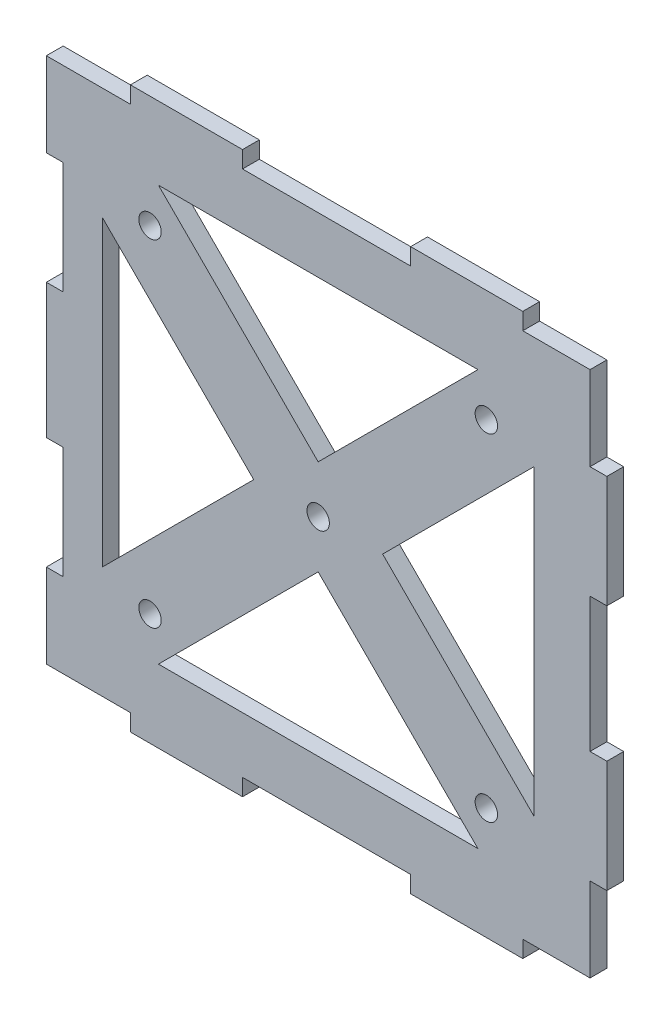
from build123d import *

# Parameters (mm, degrees)
ESQUISSE1_W             = 97
ESQUISSE1_H             = 94
ESQUISSE1_W_2           = 77
ESQUISSE1_H_2           = 74
ESQUISSE1_R             = 2
BOSS_EXTRU_1_DEPTH      = 3
ENL_V_MAT_EXTRU_1_REACH = 131.232
ESQUISSE2_W             = 3
ESQUISSE2_H             = 20
ESQUISSE3_W             = 20
ESQUISSE3_H             = 3
BOSS_EXTRU_2_DEPTH      = 3
ESQUISSE4_W             = 3
ESQUISSE4_H             = 20
BOSS_EXTRU_3_DEPTH      = 3
ESQUISSE5_W             = 20
ESQUISSE5_H             = 3
BOSS_EXTRU_4_DEPTH      = 3


with BuildPart() as part:
    # Esquisse1 → Boss.-Extru.1 (new body)
    # profile 1 of 2: a face of its own
    with BuildSketch(Plane.XY):
        with Locations((-36.351443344, 50.427454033)):
            Rectangle(ESQUISSE1_W, ESQUISSE1_H)
        with Locations((-36.351443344, 50.427454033)):
            Rectangle(ESQUISSE1_W_2, ESQUISSE1_H_2, mode=Mode.SUBTRACT)
    # profile 2 of 2: a face of its own
    with BuildSketch(Plane.XY):
        Polygon((-64.851443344, 87.427454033), (-74.851443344, 87.427454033), (-74.851443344, 77.427454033), (-47.851443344, 50.427454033), (-74.851443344, 23.427454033), (-74.851443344, 13.427454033), (-64.851443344, 13.427454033), (-36.351443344, 41.927454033), (-7.851443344, 13.427454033), (2.148556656, 13.427454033), (2.148556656, 23.427454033), (-24.851443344, 50.427454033), (2.148556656, 77.427454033), (2.148556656, 87.427454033), (-7.851443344, 87.427454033), (-36.351443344, 58.927454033), align=None)
        with Locations((-66.351443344, 20.427454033)):
            Circle(ESQUISSE1_R, mode=Mode.SUBTRACT)
        with Locations((-6.351443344, 20.427454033)):
            Circle(ESQUISSE1_R, mode=Mode.SUBTRACT)
        with Locations((-66.351443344, 80.427454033)):
            Circle(ESQUISSE1_R, mode=Mode.SUBTRACT)
        with Locations((-36.351443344, 50.427454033)):
            Circle(ESQUISSE1_R, mode=Mode.SUBTRACT)
        with Locations((-6.351443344, 80.427454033)):
            Circle(ESQUISSE1_R, mode=Mode.SUBTRACT)
    extrude(amount=BOSS_EXTRU_1_DEPTH)

    # Esquisse2 → Enl_v. mat.-Extru.1 (cut, up to next)
    with BuildSketch(Plane.XY.offset(3), mode=Mode.PRIVATE) as enl_v_mat_extru_1_sk1:
        with Locations((-83.351443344, 28.427454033)):
            Rectangle(ESQUISSE2_W, ESQUISSE2_H)
    enl_v_mat_extru_1_tool1 = extrude(enl_v_mat_extru_1_sk1.sketch, amount=-ENL_V_MAT_EXTRU_1_REACH, mode=Mode.PRIVATE) & part.part
    # Esquisse2 → Enl_v. mat.-Extru.1 (cut, up to next)
    with BuildSketch(Plane.XY.offset(3), mode=Mode.PRIVATE) as enl_v_mat_extru_1_sk2:
        with Locations((-83.351443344, 72.427454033)):
            Rectangle(ESQUISSE2_W, ESQUISSE2_H)
    enl_v_mat_extru_1_tool2 = extrude(enl_v_mat_extru_1_sk2.sketch, amount=-ENL_V_MAT_EXTRU_1_REACH, mode=Mode.PRIVATE) & part.part
    add(enl_v_mat_extru_1_tool1.solids().sort_by_distance((-83.351443, 28.427454, 3))[0], mode=Mode.SUBTRACT)
    add(enl_v_mat_extru_1_tool2.solids().sort_by_distance((-83.351443, 72.427454, 3))[0], mode=Mode.SUBTRACT)

    # Esquisse3 → Boss.-Extru.2 (add)
    with BuildSketch(Plane(origin=(0, 97.427454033, 0), x_dir=(1, 0, 0), z_dir=(0, 1, 0))):
        with Locations((-59.851443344, -1.5)):
            Rectangle(ESQUISSE3_W, ESQUISSE3_H)
        with Locations((-9.851443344, -1.5)):
            Rectangle(ESQUISSE3_W, ESQUISSE3_H)
    extrude(amount=BOSS_EXTRU_2_DEPTH)

    # Esquisse4 → Boss.-Extru.3 (add)
    with BuildSketch(Plane(origin=(12.148556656, 0, 0), x_dir=(0, 0, -1), z_dir=(1, 0, 0))):
        with Locations((-1.5, 72.427454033)):
            Rectangle(ESQUISSE4_W, ESQUISSE4_H)
        with Locations((-1.5, 28.427454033)):
            Rectangle(ESQUISSE4_W, ESQUISSE4_H)
    extrude(amount=BOSS_EXTRU_3_DEPTH)

    # Esquisse5 → Boss.-Extru.4 (add)
    with BuildSketch(Plane.XZ.offset(-3.427454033)):
        with Locations((-59.851443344, 1.5)):
            Rectangle(ESQUISSE5_W, ESQUISSE5_H)
        with Locations((-9.851443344, 1.5)):
            Rectangle(ESQUISSE5_W, ESQUISSE5_H)
    extrude(amount=BOSS_EXTRU_4_DEPTH)


solid = part.part
